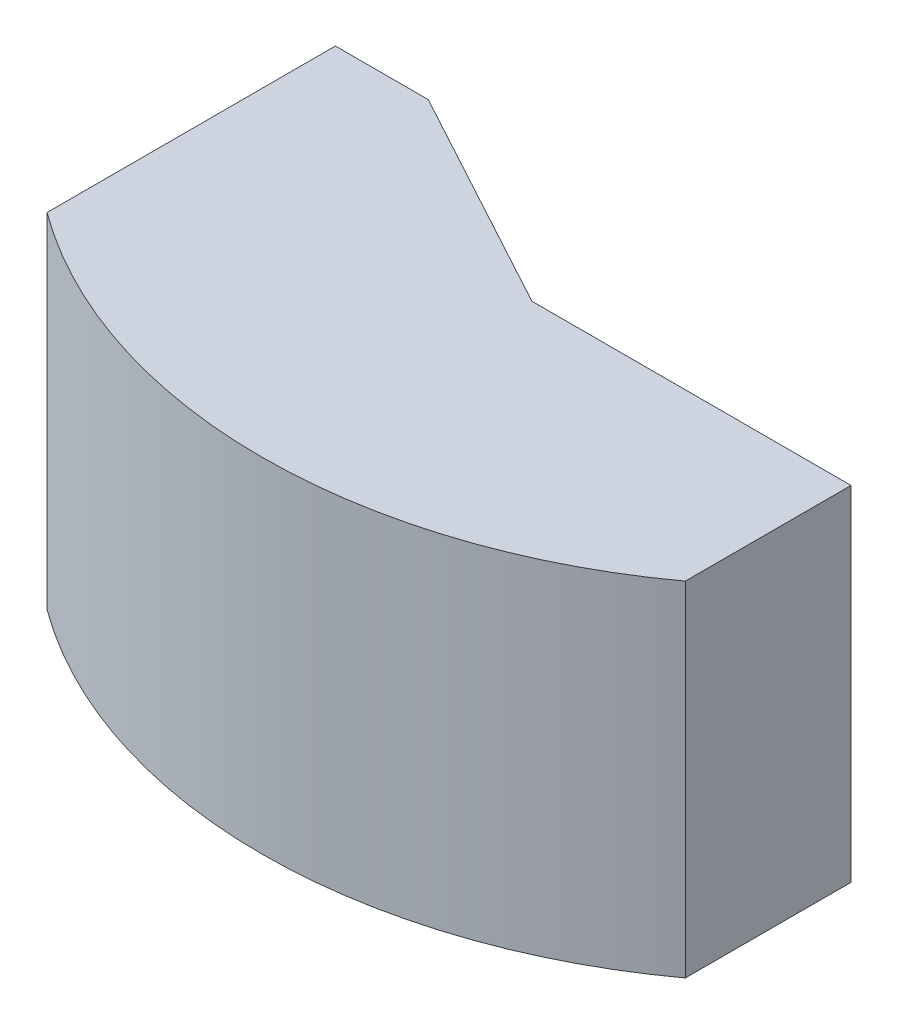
ISO-10303-21;
HEADER;
FILE_DESCRIPTION(('STEP AP214'),'2;1');
FILE_NAME('part.step','',(''),(''),'','','');
FILE_SCHEMA(('AUTOMOTIVE_DESIGN { 1 0 10303 214 1 1 1 1 }'));
ENDSEC;
DATA;
#1=APPLICATION_CONTEXT('core data for automotive mechanical design processes');
#2=APPLICATION_PROTOCOL_DEFINITION('international standard','automotive_design',2000,#1);
#3=PRODUCT_CONTEXT('',#1,'mechanical');
#4=PRODUCT('Part','Part','',(#3));
#5=PRODUCT_RELATED_PRODUCT_CATEGORY('part','',(#4));
#6=PRODUCT_DEFINITION_FORMATION('','',#4);
#7=PRODUCT_DEFINITION_CONTEXT('part definition',#1,'design');
#8=PRODUCT_DEFINITION('design','',#6,#7);
#9=PRODUCT_DEFINITION_SHAPE('','',#8);
#10=(LENGTH_UNIT() NAMED_UNIT(*) SI_UNIT(.MILLI.,.METRE.));
#11=(NAMED_UNIT(*) PLANE_ANGLE_UNIT() SI_UNIT($,.RADIAN.));
#12=(NAMED_UNIT(*) SI_UNIT($,.STERADIAN.) SOLID_ANGLE_UNIT());
#13=UNCERTAINTY_MEASURE_WITH_UNIT(LENGTH_MEASURE(1.E-05),#10,'distance_accuracy_value','');
#14=(GEOMETRIC_REPRESENTATION_CONTEXT(3) GLOBAL_UNCERTAINTY_ASSIGNED_CONTEXT((#13)) GLOBAL_UNIT_ASSIGNED_CONTEXT((#10,
#11,#12)) REPRESENTATION_CONTEXT('',''));
#15=CARTESIAN_POINT('',(0.,0.,0.));
#16=DIRECTION('',(0.,0.,1.));
#17=DIRECTION('',(1.,0.,0.));
#18=AXIS2_PLACEMENT_3D('',#15,#16,#17);
#19=CARTESIAN_POINT('',(-38.1,2.53999999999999,0.));
#20=DIRECTION('',(0.,1.,0.));
#21=DIRECTION('',(0.,0.,1.));
#22=AXIS2_PLACEMENT_3D('',#19,#20,#21);
#23=PLANE('',#22);
#24=DIRECTION('',(0.,0.,-1.));
#25=VECTOR('',#24,1.);
#26=CARTESIAN_POINT('',(82.55,2.53999999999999,69.85));
#27=LINE('',#26,#25);
#28=CARTESIAN_POINT('',(82.55,2.53999999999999,112.701319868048));
#29=VERTEX_POINT('',#28);
#30=CARTESIAN_POINT('',(82.55,2.53999999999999,69.85));
#31=VERTEX_POINT('',#30);
#32=EDGE_CURVE('E84',#29,#31,#27,.T.);
#33=ORIENTED_EDGE('',*,*,#32,.F.);
#34=CARTESIAN_POINT('',(0.,2.53999999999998,0.));
#35=DIRECTION('',(0.,-1.,0.));
#36=DIRECTION('',(0.,0.,-1.));
#37=AXIS2_PLACEMENT_3D('',#34,#35,#36);
#38=CIRCLE('',#37,139.7);
#39=CARTESIAN_POINT('',(-82.55,2.53999999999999,112.701319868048));
#40=VERTEX_POINT('',#39);
#41=EDGE_CURVE('E11',#29,#40,#38,.T.);
#42=ORIENTED_EDGE('',*,*,#41,.T.);
#43=DIRECTION('',(0.,0.,1.));
#44=VECTOR('',#43,1.);
#45=CARTESIAN_POINT('',(-82.55,2.53999999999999,171.960607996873));
#46=LINE('',#45,#44);
#47=CARTESIAN_POINT('',(-82.55,2.53999999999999,38.1));
#48=VERTEX_POINT('',#47);
#49=EDGE_CURVE('E111',#48,#40,#46,.T.);
#50=ORIENTED_EDGE('',*,*,#49,.F.);
#51=DIRECTION('',(-1.,0.,0.));
#52=VECTOR('',#51,1.);
#53=CARTESIAN_POINT('',(-82.55,2.53999999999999,38.1));
#54=LINE('',#53,#52);
#55=CARTESIAN_POINT('',(-58.5441073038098,2.53999999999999,38.1));
#56=VERTEX_POINT('',#55);
#57=EDGE_CURVE('E107',#56,#48,#54,.T.);
#58=ORIENTED_EDGE('',*,*,#57,.F.);
#59=DIRECTION('',(-0.879049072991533,0.,-0.476731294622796));
#60=VECTOR('',#59,1.);
#61=CARTESIAN_POINT('',(0.,2.53999999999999,69.85));
#62=LINE('',#61,#60);
#63=CARTESIAN_POINT('',(0.,2.53999999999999,69.85));
#64=VERTEX_POINT('',#63);
#65=EDGE_CURVE('E105',#64,#56,#62,.T.);
#66=ORIENTED_EDGE('',*,*,#65,.F.);
#67=DIRECTION('',(-1.,0.,0.));
#68=VECTOR('',#67,1.);
#69=CARTESIAN_POINT('',(0.,2.53999999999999,69.85));
#70=LINE('',#69,#68);
#71=EDGE_CURVE('E93',#31,#64,#70,.T.);
#72=ORIENTED_EDGE('',*,*,#71,.F.);
#73=EDGE_LOOP('',(#33,#42,#50,#58,#66,#72));
#74=FACE_BOUND('',#73,.T.);
#75=ADVANCED_FACE('F33',(#74),#23,.F.);
#76=CARTESIAN_POINT('',(0.,0.,0.));
#77=DIRECTION('',(0.,-1.,0.));
#78=DIRECTION('',(0.,0.,-1.));
#79=AXIS2_PLACEMENT_3D('',#76,#77,#78);
#80=CYLINDRICAL_SURFACE('',#79,139.7);
#81=DIRECTION('',(0.,-1.,0.));
#82=VECTOR('',#81,1.);
#83=CARTESIAN_POINT('',(82.55,0.,112.701319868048));
#84=LINE('',#83,#82);
#85=CARTESIAN_POINT('',(82.55,91.44,112.701319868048));
#86=VERTEX_POINT('',#85);
#87=EDGE_CURVE('E89',#86,#29,#84,.T.);
#88=ORIENTED_EDGE('',*,*,#87,.F.);
#89=CARTESIAN_POINT('',(0.,91.44,0.));
#90=DIRECTION('',(0.,-1.,0.));
#91=DIRECTION('',(0.,0.,-1.));
#92=AXIS2_PLACEMENT_3D('',#89,#90,#91);
#93=CIRCLE('',#92,139.7);
#94=CARTESIAN_POINT('',(-82.55,91.44,112.701319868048));
#95=VERTEX_POINT('',#94);
#96=EDGE_CURVE('E40',#86,#95,#93,.T.);
#97=ORIENTED_EDGE('',*,*,#96,.T.);
#98=DIRECTION('',(0.,-1.,0.));
#99=VECTOR('',#98,1.);
#100=CARTESIAN_POINT('',(-82.55,0.,112.701319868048));
#101=LINE('',#100,#99);
#102=EDGE_CURVE('E47',#40,#95,#101,.F.);
#103=ORIENTED_EDGE('',*,*,#102,.F.);
#104=ORIENTED_EDGE('',*,*,#41,.F.);
#105=EDGE_LOOP('',(#88,#97,#103,#104));
#106=FACE_BOUND('',#105,.T.);
#107=ADVANCED_FACE('F131',(#106),#80,.T.);
#108=CARTESIAN_POINT('',(-53.9750000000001,91.44,0.));
#109=DIRECTION('',(0.,-1.,0.));
#110=DIRECTION('',(0.,0.,-1.));
#111=AXIS2_PLACEMENT_3D('',#108,#109,#110);
#112=PLANE('',#111);
#113=DIRECTION('',(0.,0.,-1.));
#114=VECTOR('',#113,1.);
#115=CARTESIAN_POINT('',(82.55,91.44,69.85));
#116=LINE('',#115,#114);
#117=CARTESIAN_POINT('',(82.55,91.44,69.85));
#118=VERTEX_POINT('',#117);
#119=EDGE_CURVE('E55',#86,#118,#116,.T.);
#120=ORIENTED_EDGE('',*,*,#119,.T.);
#121=DIRECTION('',(-1.,0.,0.));
#122=VECTOR('',#121,1.);
#123=CARTESIAN_POINT('',(0.,91.44,69.85));
#124=LINE('',#123,#122);
#125=CARTESIAN_POINT('',(0.,91.44,69.85));
#126=VERTEX_POINT('',#125);
#127=EDGE_CURVE('E100',#118,#126,#124,.T.);
#128=ORIENTED_EDGE('',*,*,#127,.T.);
#129=DIRECTION('',(-0.879049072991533,0.,-0.476731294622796));
#130=VECTOR('',#129,1.);
#131=CARTESIAN_POINT('',(0.,91.44,69.85));
#132=LINE('',#131,#130);
#133=CARTESIAN_POINT('',(-58.5441073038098,91.44,38.1));
#134=VERTEX_POINT('',#133);
#135=EDGE_CURVE('E116',#126,#134,#132,.T.);
#136=ORIENTED_EDGE('',*,*,#135,.T.);
#137=DIRECTION('',(-1.,0.,0.));
#138=VECTOR('',#137,1.);
#139=CARTESIAN_POINT('',(-82.55,91.44,38.1));
#140=LINE('',#139,#138);
#141=CARTESIAN_POINT('',(-82.55,91.44,38.1));
#142=VERTEX_POINT('',#141);
#143=EDGE_CURVE('E119',#134,#142,#140,.T.);
#144=ORIENTED_EDGE('',*,*,#143,.T.);
#145=DIRECTION('',(0.,0.,1.));
#146=VECTOR('',#145,1.);
#147=CARTESIAN_POINT('',(-82.55,91.44,171.960607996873));
#148=LINE('',#147,#146);
#149=EDGE_CURVE('E94',#142,#95,#148,.T.);
#150=ORIENTED_EDGE('',*,*,#149,.T.);
#151=ORIENTED_EDGE('',*,*,#96,.F.);
#152=EDGE_LOOP('',(#120,#128,#136,#144,#150,#151));
#153=FACE_BOUND('',#152,.T.);
#154=ADVANCED_FACE('F133',(#153),#112,.F.);
#155=CARTESIAN_POINT('',(82.55,2.53999999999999,69.85));
#156=DIRECTION('',(1.,0.,0.));
#157=DIRECTION('',(0.,0.,-1.));
#158=AXIS2_PLACEMENT_3D('',#155,#156,#157);
#159=PLANE('',#158);
#160=ORIENTED_EDGE('',*,*,#87,.T.);
#161=ORIENTED_EDGE('',*,*,#32,.T.);
#162=DIRECTION('',(0.,1.,0.));
#163=VECTOR('',#162,1.);
#164=CARTESIAN_POINT('',(82.55,2.53999999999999,69.85));
#165=LINE('',#164,#163);
#166=EDGE_CURVE('E87',#31,#118,#165,.T.);
#167=ORIENTED_EDGE('',*,*,#166,.T.);
#168=ORIENTED_EDGE('',*,*,#119,.F.);
#169=EDGE_LOOP('',(#160,#161,#167,#168));
#170=FACE_BOUND('',#169,.T.);
#171=ADVANCED_FACE('F86',(#170),#159,.T.);
#172=CARTESIAN_POINT('',(-82.55,2.53999999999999,171.960607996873));
#173=DIRECTION('',(-1.,0.,0.));
#174=DIRECTION('',(0.,0.,1.));
#175=AXIS2_PLACEMENT_3D('',#172,#173,#174);
#176=PLANE('',#175);
#177=ORIENTED_EDGE('',*,*,#102,.T.);
#178=ORIENTED_EDGE('',*,*,#149,.F.);
#179=DIRECTION('',(0.,1.,0.));
#180=VECTOR('',#179,1.);
#181=CARTESIAN_POINT('',(-82.55,2.53999999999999,38.1));
#182=LINE('',#181,#180);
#183=EDGE_CURVE('E113',#48,#142,#182,.T.);
#184=ORIENTED_EDGE('',*,*,#183,.F.);
#185=ORIENTED_EDGE('',*,*,#49,.T.);
#186=EDGE_LOOP('',(#177,#178,#184,#185));
#187=FACE_BOUND('',#186,.T.);
#188=ADVANCED_FACE('F136',(#187),#176,.T.);
#189=CARTESIAN_POINT('',(0.,2.53999999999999,69.85));
#190=DIRECTION('',(0.,0.,-1.));
#191=DIRECTION('',(-1.,0.,0.));
#192=AXIS2_PLACEMENT_3D('',#189,#190,#191);
#193=PLANE('',#192);
#194=ORIENTED_EDGE('',*,*,#127,.F.);
#195=ORIENTED_EDGE('',*,*,#166,.F.);
#196=ORIENTED_EDGE('',*,*,#71,.T.);
#197=DIRECTION('',(0.,1.,0.));
#198=VECTOR('',#197,1.);
#199=CARTESIAN_POINT('',(0.,2.53999999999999,69.85));
#200=LINE('',#199,#198);
#201=EDGE_CURVE('E101',#64,#126,#200,.T.);
#202=ORIENTED_EDGE('',*,*,#201,.T.);
#203=EDGE_LOOP('',(#194,#195,#196,#202));
#204=FACE_BOUND('',#203,.T.);
#205=ADVANCED_FACE('F97',(#204),#193,.T.);
#206=CARTESIAN_POINT('',(0.,2.53999999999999,69.85));
#207=DIRECTION('',(0.476731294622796,0.,-0.879049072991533));
#208=DIRECTION('',(-0.879049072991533,0.,-0.476731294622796));
#209=AXIS2_PLACEMENT_3D('',#206,#207,#208);
#210=PLANE('',#209);
#211=ORIENTED_EDGE('',*,*,#135,.F.);
#212=ORIENTED_EDGE('',*,*,#201,.F.);
#213=ORIENTED_EDGE('',*,*,#65,.T.);
#214=DIRECTION('',(0.,1.,0.));
#215=VECTOR('',#214,1.);
#216=CARTESIAN_POINT('',(-58.5441073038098,2.53999999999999,38.1));
#217=LINE('',#216,#215);
#218=EDGE_CURVE('E124',#56,#134,#217,.T.);
#219=ORIENTED_EDGE('',*,*,#218,.T.);
#220=EDGE_LOOP('',(#211,#212,#213,#219));
#221=FACE_BOUND('',#220,.T.);
#222=ADVANCED_FACE('F143',(#221),#210,.T.);
#223=CARTESIAN_POINT('',(-82.55,2.53999999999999,38.1));
#224=DIRECTION('',(0.,0.,-1.));
#225=DIRECTION('',(-1.,0.,0.));
#226=AXIS2_PLACEMENT_3D('',#223,#224,#225);
#227=PLANE('',#226);
#228=ORIENTED_EDGE('',*,*,#143,.F.);
#229=ORIENTED_EDGE('',*,*,#218,.F.);
#230=ORIENTED_EDGE('',*,*,#57,.T.);
#231=ORIENTED_EDGE('',*,*,#183,.T.);
#232=EDGE_LOOP('',(#228,#229,#230,#231));
#233=FACE_BOUND('',#232,.T.);
#234=ADVANCED_FACE('F140',(#233),#227,.T.);
#235=CLOSED_SHELL('',(#75,#107,#154,#171,#188,#205,#222,#234));
#236=MANIFOLD_SOLID_BREP('B2',#235);
#237=ADVANCED_BREP_SHAPE_REPRESENTATION('',(#18,#236),#14);
#238=SHAPE_DEFINITION_REPRESENTATION(#9,#237);
ENDSEC;
END-ISO-10303-21;
